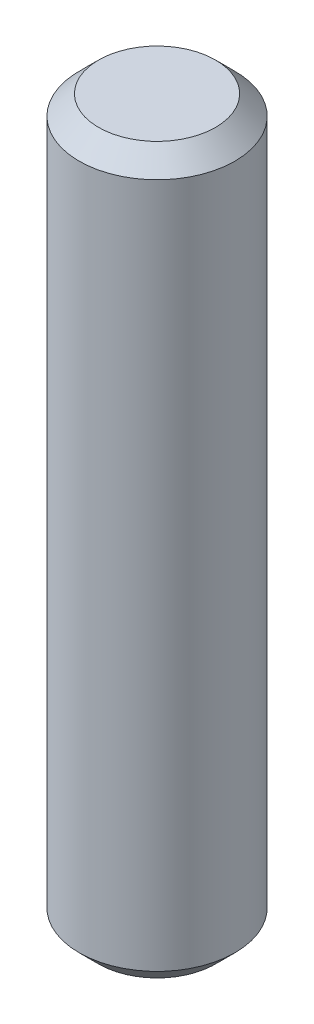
ISO-10303-21;
HEADER;
FILE_DESCRIPTION(('STEP AP214'),'2;1');
FILE_NAME('part.step','',(''),(''),'','','');
FILE_SCHEMA(('AUTOMOTIVE_DESIGN { 1 0 10303 214 1 1 1 1 }'));
ENDSEC;
DATA;
#1=APPLICATION_CONTEXT('core data for automotive mechanical design processes');
#2=APPLICATION_PROTOCOL_DEFINITION('international standard','automotive_design',2000,#1);
#3=PRODUCT_CONTEXT('',#1,'mechanical');
#4=PRODUCT('Part','Part','',(#3));
#5=PRODUCT_RELATED_PRODUCT_CATEGORY('part','',(#4));
#6=PRODUCT_DEFINITION_FORMATION('','',#4);
#7=PRODUCT_DEFINITION_CONTEXT('part definition',#1,'design');
#8=PRODUCT_DEFINITION('design','',#6,#7);
#9=PRODUCT_DEFINITION_SHAPE('','',#8);
#10=(LENGTH_UNIT() NAMED_UNIT(*) SI_UNIT(.MILLI.,.METRE.));
#11=(NAMED_UNIT(*) PLANE_ANGLE_UNIT() SI_UNIT($,.RADIAN.));
#12=(NAMED_UNIT(*) SI_UNIT($,.STERADIAN.) SOLID_ANGLE_UNIT());
#13=UNCERTAINTY_MEASURE_WITH_UNIT(LENGTH_MEASURE(1.E-05),#10,'distance_accuracy_value','');
#14=(GEOMETRIC_REPRESENTATION_CONTEXT(3) GLOBAL_UNCERTAINTY_ASSIGNED_CONTEXT((#13)) GLOBAL_UNIT_ASSIGNED_CONTEXT((#10,
#11,#12)) REPRESENTATION_CONTEXT('',''));
#15=CARTESIAN_POINT('',(0.,0.,0.));
#16=DIRECTION('',(0.,0.,1.));
#17=DIRECTION('',(1.,0.,0.));
#18=AXIS2_PLACEMENT_3D('',#15,#16,#17);
#19=CARTESIAN_POINT('',(0.999911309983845,18.5999999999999,0.));
#20=DIRECTION('',(0.,1.,0.));
#21=DIRECTION('',(-1.,0.,0.));
#22=AXIS2_PLACEMENT_3D('',#19,#20,#21);
#23=PLANE('',#22);
#24=CARTESIAN_POINT('',(0.,18.600000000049,0.));
#25=DIRECTION('',(0.,-1.,0.));
#26=DIRECTION('',(1.,0.,0.));
#27=AXIS2_PLACEMENT_3D('',#24,#25,#26);
#28=CIRCLE('',#27,1.50000000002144);
#29=CARTESIAN_POINT('',(1.50000000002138,18.600000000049,0.));
#30=VERTEX_POINT('',#29);
#31=EDGE_CURVE('E18',#30,#30,#28,.T.);
#32=ORIENTED_EDGE('',*,*,#31,.F.);
#33=EDGE_LOOP('',(#32));
#34=FACE_BOUND('',#33,.T.);
#35=ADVANCED_FACE('F15',(#34),#23,.T.);
#36=CARTESIAN_POINT('',(0.999911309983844,0.,0.));
#37=DIRECTION('',(0.,-1.,0.));
#38=DIRECTION('',(1.,0.,0.));
#39=AXIS2_PLACEMENT_3D('',#36,#37,#38);
#40=PLANE('',#39);
#41=CARTESIAN_POINT('',(0.,0.,0.));
#42=DIRECTION('',(0.,1.,0.));
#43=DIRECTION('',(-1.,0.,0.));
#44=AXIS2_PLACEMENT_3D('',#41,#42,#43);
#45=CIRCLE('',#44,1.50000000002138);
#46=CARTESIAN_POINT('',(-1.50000000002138,0.,0.));
#47=VERTEX_POINT('',#46);
#48=EDGE_CURVE('E27',#47,#47,#45,.T.);
#49=ORIENTED_EDGE('',*,*,#48,.F.);
#50=EDGE_LOOP('',(#49));
#51=FACE_BOUND('',#50,.T.);
#52=ADVANCED_FACE('F38',(#51),#40,.T.);
#53=CARTESIAN_POINT('',(0.,18.1000000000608,0.));
#54=DIRECTION('',(0.,-1.,0.));
#55=DIRECTION('',(1.,0.,0.));
#56=AXIS2_PLACEMENT_3D('',#53,#54,#55);
#57=CONICAL_SURFACE('',#56,2.00000000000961,0.785398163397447);
#58=CARTESIAN_POINT('',(0.,18.1,0.));
#59=DIRECTION('',(0.,-1.,0.));
#60=DIRECTION('',(1.,0.,0.));
#61=AXIS2_PLACEMENT_3D('',#58,#59,#60);
#62=CIRCLE('',#61,2.00000000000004);
#63=CARTESIAN_POINT('',(1.99999999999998,18.1,0.));
#64=VERTEX_POINT('',#63);
#65=EDGE_CURVE('E22',#64,#64,#62,.T.);
#66=ORIENTED_EDGE('',*,*,#65,.F.);
#67=EDGE_LOOP('',(#66));
#68=FACE_BOUND('',#67,.T.);
#69=ORIENTED_EDGE('',*,*,#31,.T.);
#70=EDGE_LOOP('',(#69));
#71=FACE_BOUND('',#70,.T.);
#72=ADVANCED_FACE('F35',(#68,#71),#57,.T.);
#73=CARTESIAN_POINT('',(0.,0.49999999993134,0.));
#74=DIRECTION('',(0.,1.,0.));
#75=DIRECTION('',(-1.,0.,0.));
#76=AXIS2_PLACEMENT_3D('',#73,#74,#75);
#77=CONICAL_SURFACE('',#76,1.9999999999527,0.785398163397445);
#78=CARTESIAN_POINT('',(0.,0.499999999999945,0.));
#79=DIRECTION('',(0.,-1.,0.));
#80=DIRECTION('',(1.,0.,0.));
#81=AXIS2_PLACEMENT_3D('',#78,#79,#80);
#82=CIRCLE('',#81,2.00000000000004);
#83=CARTESIAN_POINT('',(2.00000000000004,0.499999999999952,0.));
#84=VERTEX_POINT('',#83);
#85=EDGE_CURVE('E10',#84,#84,#82,.F.);
#86=ORIENTED_EDGE('',*,*,#85,.F.);
#87=EDGE_LOOP('',(#86));
#88=FACE_BOUND('',#87,.T.);
#89=ORIENTED_EDGE('',*,*,#48,.T.);
#90=EDGE_LOOP('',(#89));
#91=FACE_BOUND('',#90,.T.);
#92=ADVANCED_FACE('F46',(#88,#91),#77,.T.);
#93=CARTESIAN_POINT('',(3.49243203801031E-12,-999.999999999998,0.));
#94=DIRECTION('',(0.,-1.,0.));
#95=DIRECTION('',(1.,0.,0.));
#96=AXIS2_PLACEMENT_3D('',#93,#94,#95);
#97=CYLINDRICAL_SURFACE('',#96,2.00000000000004);
#98=ORIENTED_EDGE('',*,*,#85,.T.);
#99=EDGE_LOOP('',(#98));
#100=FACE_BOUND('',#99,.T.);
#101=ORIENTED_EDGE('',*,*,#65,.T.);
#102=EDGE_LOOP('',(#101));
#103=FACE_BOUND('',#102,.T.);
#104=ADVANCED_FACE('F44',(#100,#103),#97,.T.);
#105=CLOSED_SHELL('',(#35,#52,#72,#92,#104));
#106=MANIFOLD_SOLID_BREP('B1',#105);
#107=ADVANCED_BREP_SHAPE_REPRESENTATION('',(#18,#106),#14);
#108=SHAPE_DEFINITION_REPRESENTATION(#9,#107);
ENDSEC;
END-ISO-10303-21;
